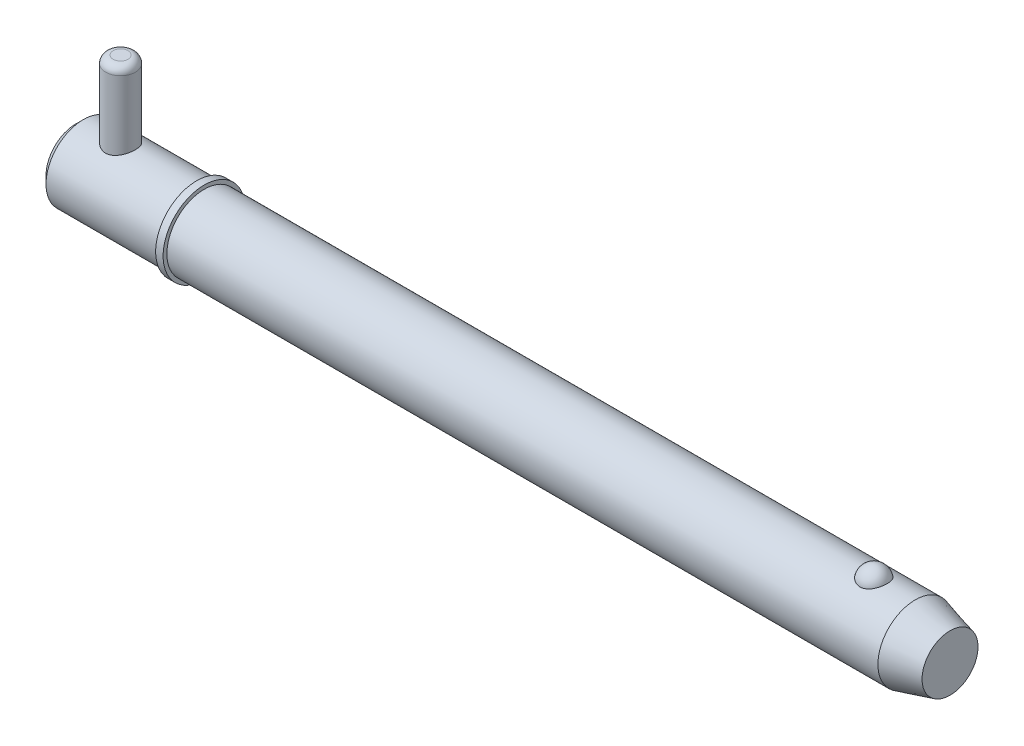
ISO-10303-21;
HEADER;
FILE_DESCRIPTION(('STEP AP214'),'2;1');
FILE_NAME('part.step','',(''),(''),'','','');
FILE_SCHEMA(('AUTOMOTIVE_DESIGN { 1 0 10303 214 1 1 1 1 }'));
ENDSEC;
DATA;
#1=APPLICATION_CONTEXT('core data for automotive mechanical design processes');
#2=APPLICATION_PROTOCOL_DEFINITION('international standard','automotive_design',2000,#1);
#3=PRODUCT_CONTEXT('',#1,'mechanical');
#4=PRODUCT('Part','Part','',(#3));
#5=PRODUCT_RELATED_PRODUCT_CATEGORY('part','',(#4));
#6=PRODUCT_DEFINITION_FORMATION('','',#4);
#7=PRODUCT_DEFINITION_CONTEXT('part definition',#1,'design');
#8=PRODUCT_DEFINITION('design','',#6,#7);
#9=PRODUCT_DEFINITION_SHAPE('','',#8);
#10=(LENGTH_UNIT() NAMED_UNIT(*) SI_UNIT(.MILLI.,.METRE.));
#11=(NAMED_UNIT(*) PLANE_ANGLE_UNIT() SI_UNIT($,.RADIAN.));
#12=(NAMED_UNIT(*) SI_UNIT($,.STERADIAN.) SOLID_ANGLE_UNIT());
#13=UNCERTAINTY_MEASURE_WITH_UNIT(LENGTH_MEASURE(1.E-05),#10,'distance_accuracy_value','');
#14=(GEOMETRIC_REPRESENTATION_CONTEXT(3) GLOBAL_UNCERTAINTY_ASSIGNED_CONTEXT((#13)) GLOBAL_UNIT_ASSIGNED_CONTEXT((#10,
#11,#12)) REPRESENTATION_CONTEXT('',''));
#15=CARTESIAN_POINT('',(0.,0.,0.));
#16=DIRECTION('',(0.,0.,1.));
#17=DIRECTION('',(1.,0.,0.));
#18=AXIS2_PLACEMENT_3D('',#15,#16,#17);
#19=CARTESIAN_POINT('',(9.525,23.81,0.));
#20=DIRECTION('',(0.,-1.,0.));
#21=DIRECTION('',(0.,0.,-1.));
#22=AXIS2_PLACEMENT_3D('',#19,#20,#21);
#23=CYLINDRICAL_SURFACE('',#22,3.175);
#24=CARTESIAN_POINT('',(9.525,-6.3525,0.));
#25=DIRECTION('',(0.,1.,0.));
#26=DIRECTION('',(0.,0.,1.));
#27=AXIS2_PLACEMENT_3D('',#24,#25,#26);
#28=CIRCLE('',#27,3.175);
#29=CARTESIAN_POINT('',(9.525,-6.3525,3.175));
#30=VERTEX_POINT('',#29);
#31=EDGE_CURVE('P0_E25',#30,#30,#28,.T.);
#32=ORIENTED_EDGE('',*,*,#31,.T.);
#33=EDGE_LOOP('',(#32));
#34=FACE_BOUND('',#33,.T.);
#35=CARTESIAN_POINT('',(9.525,22.2225,0.));
#36=DIRECTION('',(0.,1.,0.));
#37=DIRECTION('',(0.,0.,1.));
#38=AXIS2_PLACEMENT_3D('',#35,#36,#37);
#39=CIRCLE('',#38,3.175);
#40=CARTESIAN_POINT('',(9.525,22.2225,3.175));
#41=VERTEX_POINT('',#40);
#42=EDGE_CURVE('P0_E29',#41,#41,#39,.F.);
#43=ORIENTED_EDGE('',*,*,#42,.T.);
#44=EDGE_LOOP('',(#43));
#45=FACE_BOUND('',#44,.T.);
#46=ADVANCED_FACE('P0_F14',(#34,#45),#23,.T.);
#47=CARTESIAN_POINT('',(9.525,23.81,0.));
#48=DIRECTION('',(0.,1.,0.));
#49=DIRECTION('',(0.,0.,1.));
#50=AXIS2_PLACEMENT_3D('',#47,#48,#49);
#51=PLANE('',#50);
#52=CARTESIAN_POINT('',(9.525,23.81,0.));
#53=DIRECTION('',(0.,1.,0.));
#54=DIRECTION('',(0.,0.,1.));
#55=AXIS2_PLACEMENT_3D('',#52,#53,#54);
#56=CIRCLE('',#55,1.5875);
#57=CARTESIAN_POINT('',(9.525,23.81,1.5875));
#58=VERTEX_POINT('',#57);
#59=EDGE_CURVE('P0_E10',#58,#58,#56,.T.);
#60=ORIENTED_EDGE('',*,*,#59,.T.);
#61=EDGE_LOOP('',(#60));
#62=FACE_BOUND('',#61,.T.);
#63=ADVANCED_FACE('P0_F46',(#62),#51,.T.);
#64=CARTESIAN_POINT('',(9.525,-7.94,0.));
#65=DIRECTION('',(0.,1.,0.));
#66=DIRECTION('',(0.,0.,1.));
#67=AXIS2_PLACEMENT_3D('',#64,#65,#66);
#68=PLANE('',#67);
#69=CARTESIAN_POINT('',(9.525,-7.94,0.));
#70=DIRECTION('',(0.,1.,0.));
#71=DIRECTION('',(0.,0.,1.));
#72=AXIS2_PLACEMENT_3D('',#69,#70,#71);
#73=CIRCLE('',#72,1.5875);
#74=CARTESIAN_POINT('',(9.525,-7.94,1.5875));
#75=VERTEX_POINT('',#74);
#76=EDGE_CURVE('P0_E21',#75,#75,#73,.F.);
#77=ORIENTED_EDGE('',*,*,#76,.T.);
#78=EDGE_LOOP('',(#77));
#79=FACE_BOUND('',#78,.T.);
#80=ADVANCED_FACE('P0_F43',(#79),#68,.F.);
#81=CARTESIAN_POINT('',(9.525,-6.3525,0.));
#82=DIRECTION('',(0.,1.,0.));
#83=DIRECTION('',(0.,0.,1.));
#84=AXIS2_PLACEMENT_3D('',#81,#82,#83);
#85=DEGENERATE_TOROIDAL_SURFACE('',#84,1.5875,1.5875,.T.);
#86=ORIENTED_EDGE('',*,*,#76,.F.);
#87=EDGE_LOOP('',(#86));
#88=FACE_BOUND('',#87,.T.);
#89=ORIENTED_EDGE('',*,*,#31,.F.);
#90=EDGE_LOOP('',(#89));
#91=FACE_BOUND('',#90,.T.);
#92=ADVANCED_FACE('P0_F38',(#88,#91),#85,.T.);
#93=CARTESIAN_POINT('',(9.525,22.2225,0.));
#94=DIRECTION('',(0.,1.,0.));
#95=DIRECTION('',(0.,0.,1.));
#96=AXIS2_PLACEMENT_3D('',#93,#94,#95);
#97=DEGENERATE_TOROIDAL_SURFACE('',#96,1.5875,1.5875,.T.);
#98=ORIENTED_EDGE('',*,*,#42,.F.);
#99=EDGE_LOOP('',(#98));
#100=FACE_BOUND('',#99,.T.);
#101=ORIENTED_EDGE('',*,*,#59,.F.);
#102=EDGE_LOOP('',(#101));
#103=FACE_BOUND('',#102,.T.);
#104=ADVANCED_FACE('P0_F16',(#100,#103),#97,.T.);
#105=CLOSED_SHELL('',(#46,#63,#80,#92,#104));
#106=MANIFOLD_SOLID_BREP('P0_B1',#105);
#107=CARTESIAN_POINT('',(0.,0.,0.));
#108=DIRECTION('',(1.,0.,0.));
#109=DIRECTION('',(0.,0.,-1.));
#110=AXIS2_PLACEMENT_3D('',#107,#108,#109);
#111=CYLINDRICAL_SURFACE('',#110,7.94);
#112=CARTESIAN_POINT('',(178.651879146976,0.,0.));
#113=DIRECTION('',(1.,0.,0.));
#114=DIRECTION('',(0.,0.,-1.));
#115=AXIS2_PLACEMENT_3D('',#112,#113,#114);
#116=CIRCLE('',#115,7.94);
#117=CARTESIAN_POINT('',(178.651879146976,0.,-7.94));
#118=VERTEX_POINT('',#117);
#119=EDGE_CURVE('P1_E81',#118,#118,#116,.T.);
#120=ORIENTED_EDGE('',*,*,#119,.F.);
#121=EDGE_LOOP('',(#120));
#122=FACE_BOUND('',#121,.T.);
#123=CARTESIAN_POINT('',(27.31,0.,0.));
#124=DIRECTION('',(1.,0.,0.));
#125=DIRECTION('',(0.,0.,-1.));
#126=AXIS2_PLACEMENT_3D('',#123,#124,#125);
#127=CIRCLE('',#126,7.94);
#128=CARTESIAN_POINT('',(27.31,0.,-7.94));
#129=VERTEX_POINT('',#128);
#130=EDGE_CURVE('P1_E85',#129,#129,#127,.T.);
#131=ORIENTED_EDGE('',*,*,#130,.T.);
#132=EDGE_LOOP('',(#131));
#133=FACE_BOUND('',#132,.T.);
#134=CARTESIAN_POINT('',(169.844907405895,7.37767842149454,2.93486986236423));
#135=CARTESIAN_POINT('',(169.692749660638,7.3776732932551,2.93487505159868));
#136=CARTESIAN_POINT('',(169.540632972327,7.38258419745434,2.92262454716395));
#137=CARTESIAN_POINT('',(169.240928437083,7.40163229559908,2.87404196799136));
#138=CARTESIAN_POINT('',(169.093339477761,7.41576720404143,2.83771585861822));
#139=CARTESIAN_POINT('',(168.807018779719,7.45161576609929,2.74218769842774));
#140=CARTESIAN_POINT('',(168.668274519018,7.47331841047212,2.68301886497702));
#141=CARTESIAN_POINT('',(168.402882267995,7.52194082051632,2.54350967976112));
#142=CARTESIAN_POINT('',(168.276236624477,7.54886159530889,2.46316523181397));
#143=CARTESIAN_POINT('',(168.034534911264,7.60594671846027,2.28090375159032));
#144=CARTESIAN_POINT('',(167.919906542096,7.63618114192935,2.1784421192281));
#145=CARTESIAN_POINT('',(167.708878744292,7.69614046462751,1.95608495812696));
#146=CARTESIAN_POINT('',(167.612482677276,7.72586526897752,1.83618622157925));
#147=CARTESIAN_POINT('',(167.435938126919,7.78314821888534,1.57628086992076));
#148=CARTESIAN_POINT('',(167.356707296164,7.81055035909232,1.43561546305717));
#149=CARTESIAN_POINT('',(167.221797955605,7.85879631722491,1.14236334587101));
#150=CARTESIAN_POINT('',(167.166121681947,7.87963951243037,0.989775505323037));
#151=CARTESIAN_POINT('',(167.07881215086,7.91289645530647,0.674619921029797));
#152=CARTESIAN_POINT('',(167.04753090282,7.92518652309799,0.511941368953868));
#153=CARTESIAN_POINT('',(167.010975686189,7.93958930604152,0.183247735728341));
#154=CARTESIAN_POINT('',(167.005701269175,7.94170219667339,0.0172327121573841));
#155=CARTESIAN_POINT('',(167.021231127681,7.93554931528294,-0.312672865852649));
#156=CARTESIAN_POINT('',(167.041925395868,7.92732732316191,-0.476569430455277));
#157=CARTESIAN_POINT('',(167.10878655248,7.90141534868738,-0.79830524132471));
#158=CARTESIAN_POINT('',(167.154953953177,7.88372517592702,-0.956144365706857));
#159=CARTESIAN_POINT('',(167.271898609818,7.84066230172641,-1.26152073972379));
#160=CARTESIAN_POINT('',(167.342704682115,7.81528060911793,-1.40904568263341));
#161=CARTESIAN_POINT('',(167.507478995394,7.75948672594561,-1.68950598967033));
#162=CARTESIAN_POINT('',(167.601448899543,7.72907417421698,-1.82244030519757));
#163=CARTESIAN_POINT('',(167.810839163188,7.66640424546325,-2.07032792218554));
#164=CARTESIAN_POINT('',(167.926315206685,7.63414223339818,-2.18523308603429));
#165=CARTESIAN_POINT('',(168.1759006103,7.57149681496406,-2.39329737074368));
#166=CARTESIAN_POINT('',(168.310008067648,7.54111321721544,-2.48645870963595));
#167=CARTESIAN_POINT('',(168.590111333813,7.48650742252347,-2.64628132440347));
#168=CARTESIAN_POINT('',(168.735760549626,7.46215900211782,-2.71350554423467));
#169=CARTESIAN_POINT('',(169.037425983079,7.42171253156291,-2.82226614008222));
#170=CARTESIAN_POINT('',(169.193438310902,7.40561140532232,-2.86381209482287));
#171=CARTESIAN_POINT('',(169.502970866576,7.3842679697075,-2.9183907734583));
#172=CARTESIAN_POINT('',(169.656222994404,7.37852109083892,-2.93275024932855));
#173=CARTESIAN_POINT('',(169.963070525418,7.37700973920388,-2.93655208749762));
#174=CARTESIAN_POINT('',(170.116665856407,7.38124333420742,-2.92599927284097));
#175=CARTESIAN_POINT('',(170.414990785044,7.39890635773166,-2.88102897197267));
#176=CARTESIAN_POINT('',(170.559848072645,7.41205491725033,-2.84733999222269));
#177=CARTESIAN_POINT('',(170.84164329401,7.445801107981,-2.75788206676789));
#178=CARTESIAN_POINT('',(170.978580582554,7.46639934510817,-2.70211132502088));
#179=CARTESIAN_POINT('',(171.244061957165,7.51339098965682,-2.56858908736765));
#180=CARTESIAN_POINT('',(171.372354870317,7.53990200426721,-2.4903806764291));
#181=CARTESIAN_POINT('',(171.614244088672,7.59569503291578,-2.31462737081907));
#182=CARTESIAN_POINT('',(171.727837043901,7.6249776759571,-2.21707808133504));
#183=CARTESIAN_POINT('',(171.94322156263,7.68489473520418,-1.99982049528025));
#184=CARTESIAN_POINT('',(172.044148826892,7.71552419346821,-1.87925337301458));
#185=CARTESIAN_POINT('',(172.225186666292,7.77353016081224,-1.6226882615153));
#186=CARTESIAN_POINT('',(172.305293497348,7.80090608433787,-1.48668750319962));
#187=CARTESIAN_POINT('',(172.445361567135,7.85047992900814,-1.1981841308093));
#188=CARTESIAN_POINT('',(172.504587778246,7.87248183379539,-1.04529016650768));
#189=CARTESIAN_POINT('',(172.597982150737,7.90785114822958,-0.731080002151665));
#190=CARTESIAN_POINT('',(172.632149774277,7.92121837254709,-0.569763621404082));
#191=CARTESIAN_POINT('',(172.674795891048,7.93797834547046,-0.242812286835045));
#192=CARTESIAN_POINT('',(172.683204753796,7.94134405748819,-0.0771668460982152));
#193=CARTESIAN_POINT('',(172.673962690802,7.93767937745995,0.253276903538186));
#194=CARTESIAN_POINT('',(172.656312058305,7.93064910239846,0.418075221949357));
#195=CARTESIAN_POINT('',(172.595424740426,7.90695571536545,0.741525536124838));
#196=CARTESIAN_POINT('',(172.552281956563,7.8903279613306,0.900197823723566));
#197=CARTESIAN_POINT('',(172.44135358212,7.84916386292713,1.20759654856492));
#198=CARTESIAN_POINT('',(172.37356656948,7.82462706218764,1.35632241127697));
#199=CARTESIAN_POINT('',(172.214371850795,7.77006699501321,1.64032869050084));
#200=CARTESIAN_POINT('',(172.122861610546,7.74002008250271,1.7755471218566));
#201=CARTESIAN_POINT('',(171.918296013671,7.67774175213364,2.0280064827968));
#202=CARTESIAN_POINT('',(171.805241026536,7.64551037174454,2.14524772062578));
#203=CARTESIAN_POINT('',(171.560831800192,7.58265895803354,2.35778002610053));
#204=CARTESIAN_POINT('',(171.429583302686,7.5520309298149,2.45319004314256));
#205=CARTESIAN_POINT('',(171.151601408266,7.49579792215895,2.61999897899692));
#206=CARTESIAN_POINT('',(171.004867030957,7.4701932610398,2.69139637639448));
#207=CARTESIAN_POINT('',(170.692947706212,7.42622216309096,2.8105324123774));
#208=CARTESIAN_POINT('',(170.527220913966,7.40825002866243,2.85700910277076));
#209=CARTESIAN_POINT('',(170.189279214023,7.38398348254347,2.9191685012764));
#210=CARTESIAN_POINT('',(170.01706702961,7.3776842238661,2.93486399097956));
#211=CARTESIAN_POINT('',(169.844907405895,7.37767842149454,2.93486986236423));
#212=B_SPLINE_CURVE_WITH_KNOTS('',3,(#134,#135,#136,#137,#138,#139,#140,#141,#142,#143,#144,
#145,#146,#147,#148,#149,#150,#151,#152,#153,#154,#155,#156,#157,#158,#159,#160,#161,#162,#163,
#164,#165,#166,#167,#168,#169,#170,#171,#172,#173,#174,#175,#176,#177,#178,#179,#180,#181,#182,
#183,#184,#185,#186,#187,#188,#189,#190,#191,#192,#193,#194,#195,#196,#197,#198,#199,#200,#201,
#202,#203,#204,#205,#206,#207,#208,#209,#210,#211),.UNSPECIFIED.,.T.,.F.,(4,2,2,2,2,2,2,2,2,2,2,
2,2,2,2,2,2,2,2,2,2,2,2,2,2,2,2,2,2,2,2,2,2,2,2,2,2,2,4),(0.,0.455841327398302,
0.911569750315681,1.36663794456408,1.82179423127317,2.2897898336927,2.75787163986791,
3.24685368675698,3.73588214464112,4.23184282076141,4.72779494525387,5.22165321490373,
5.71552141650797,6.2099691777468,6.7044524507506,7.20023431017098,7.69596557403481,
8.18023418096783,8.66432203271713,9.12410697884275,9.58380291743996,10.0296503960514,
10.4755341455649,10.9312349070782,11.3870393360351,11.8654416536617,12.3439299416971,
12.8378875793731,13.3318558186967,13.8271581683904,14.3224549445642,14.8159385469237,
15.3094506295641,15.8051323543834,16.3008055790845,16.7937101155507,17.2866458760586,
17.8026240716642,18.3183879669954),.UNSPECIFIED.);
#213=CARTESIAN_POINT('',(169.844907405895,7.37767842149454,2.93486986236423));
#214=VERTEX_POINT('',#213);
#215=EDGE_CURVE('P1_E35',#214,#214,#212,.T.);
#216=ORIENTED_EDGE('',*,*,#215,.T.);
#217=EDGE_LOOP('',(#216));
#218=FACE_BOUND('',#217,.T.);
#219=ADVANCED_FACE('P1_F13',(#122,#133,#218),#111,.T.);
#220=CARTESIAN_POINT('',(0.,0.,0.));
#221=DIRECTION('',(-1.,0.,0.));
#222=DIRECTION('',(0.,0.,1.));
#223=AXIS2_PLACEMENT_3D('',#220,#221,#222);
#224=PLANE('',#223);
#225=CARTESIAN_POINT('',(0.,0.,0.));
#226=DIRECTION('',(1.,0.,0.));
#227=DIRECTION('',(0.,0.,-1.));
#228=AXIS2_PLACEMENT_3D('',#225,#226,#227);
#229=CIRCLE('',#228,6.352);
#230=CARTESIAN_POINT('',(0.,0.,-6.352));
#231=VERTEX_POINT('',#230);
#232=EDGE_CURVE('P1_E9',#231,#231,#229,.T.);
#233=ORIENTED_EDGE('',*,*,#232,.F.);
#234=EDGE_LOOP('',(#233));
#235=FACE_BOUND('',#234,.T.);
#236=ADVANCED_FACE('P1_F15',(#235),#224,.T.);
#237=CARTESIAN_POINT('',(1.58799999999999,0.,0.));
#238=DIRECTION('',(1.,0.,0.));
#239=DIRECTION('',(0.,0.,-1.));
#240=AXIS2_PLACEMENT_3D('',#237,#238,#239);
#241=CONICAL_SURFACE('',#240,7.94,0.78539816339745);
#242=ORIENTED_EDGE('',*,*,#232,.T.);
#243=EDGE_LOOP('',(#242));
#244=FACE_BOUND('',#243,.T.);
#245=CARTESIAN_POINT('',(1.58799999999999,0.,0.));
#246=DIRECTION('',(1.,0.,0.));
#247=DIRECTION('',(0.,0.,-1.));
#248=AXIS2_PLACEMENT_3D('',#245,#246,#247);
#249=CIRCLE('',#248,7.94);
#250=CARTESIAN_POINT('',(1.58799999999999,0.,-7.94));
#251=VERTEX_POINT('',#250);
#252=EDGE_CURVE('P1_E26',#251,#251,#249,.T.);
#253=ORIENTED_EDGE('',*,*,#252,.F.);
#254=EDGE_LOOP('',(#253));
#255=FACE_BOUND('',#254,.T.);
#256=ADVANCED_FACE('P1_F77',(#244,#255),#241,.T.);
#257=CARTESIAN_POINT('',(0.,0.,0.));
#258=DIRECTION('',(1.,0.,0.));
#259=DIRECTION('',(0.,0.,-1.));
#260=AXIS2_PLACEMENT_3D('',#257,#258,#259);
#261=CYLINDRICAL_SURFACE('',#260,7.94);
#262=CARTESIAN_POINT('',(9.525,-7.27756655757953,3.175));
#263=CARTESIAN_POINT('',(9.43992346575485,-7.27756715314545,3.17499935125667));
#264=CARTESIAN_POINT('',(9.35481882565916,-7.27906496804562,3.1715736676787));
#265=CARTESIAN_POINT('',(9.18524505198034,-7.28499816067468,3.15791803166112));
#266=CARTESIAN_POINT('',(9.100776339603,-7.28943533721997,3.14768391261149));
#267=CARTESIAN_POINT('',(8.84895715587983,-7.30698881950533,3.10684226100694));
#268=CARTESIAN_POINT('',(8.6834173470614,-7.32434654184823,3.06609574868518));
#269=CARTESIAN_POINT('',(8.36278910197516,-7.36806950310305,2.95945910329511));
#270=CARTESIAN_POINT('',(8.20766386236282,-7.39440078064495,2.89366366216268));
#271=CARTESIAN_POINT('',(7.91065319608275,-7.45304562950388,2.73907413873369));
#272=CARTESIAN_POINT('',(7.76876488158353,-7.48535789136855,2.65028508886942));
#273=CARTESIAN_POINT('',(7.49411086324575,-7.55439482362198,2.44679888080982));
#274=CARTESIAN_POINT('',(7.36219910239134,-7.59126138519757,2.33099745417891));
#275=CARTESIAN_POINT('',(7.11904234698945,-7.66408045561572,2.07909838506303));
#276=CARTESIAN_POINT('',(7.00780457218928,-7.70003264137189,1.94299368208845));
#277=CARTESIAN_POINT('',(6.80492173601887,-7.76867514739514,1.64775981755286));
#278=CARTESIAN_POINT('',(6.71422139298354,-7.80118112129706,1.48793473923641));
#279=CARTESIAN_POINT('',(6.56135788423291,-7.85754918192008,1.15376269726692));
#280=CARTESIAN_POINT('',(6.49918311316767,-7.88141478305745,0.979421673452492));
#281=CARTESIAN_POINT('',(6.40818142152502,-7.91680873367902,0.630115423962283));
#282=CARTESIAN_POINT('',(6.3778864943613,-7.9288781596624,0.455588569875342));
#283=CARTESIAN_POINT('',(6.34677743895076,-7.94127547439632,0.103539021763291));
#284=CARTESIAN_POINT('',(6.34595232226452,-7.94160773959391,-0.0739825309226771));
#285=CARTESIAN_POINT('',(6.37300128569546,-7.93082261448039,-0.416371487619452));
#286=CARTESIAN_POINT('',(6.39926693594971,-7.92034690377,-0.581389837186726));
#287=CARTESIAN_POINT('',(6.47701615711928,-7.88998770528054,-0.904449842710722));
#288=CARTESIAN_POINT('',(6.52850157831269,-7.87010352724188,-1.06249098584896));
#289=CARTESIAN_POINT('',(6.65586120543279,-7.82249343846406,-1.36995769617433));
#290=CARTESIAN_POINT('',(6.73209124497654,-7.79465387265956,-1.51921754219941));
#291=CARTESIAN_POINT('',(6.90644286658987,-7.73389606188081,-1.80321183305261));
#292=CARTESIAN_POINT('',(7.00457194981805,-7.70097607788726,-1.93794127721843));
#293=CARTESIAN_POINT('',(7.22744086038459,-7.63084889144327,-2.19843606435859));
#294=CARTESIAN_POINT('',(7.35350432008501,-7.59350211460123,-2.3230330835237));
#295=CARTESIAN_POINT('',(7.62488266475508,-7.52039654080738,-2.54979642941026));
#296=CARTESIAN_POINT('',(7.77020381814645,-7.48463826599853,-2.65195542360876));
#297=CARTESIAN_POINT('',(8.08119298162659,-7.41780943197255,-2.83361305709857));
#298=CARTESIAN_POINT('',(8.24731937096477,-7.38689959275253,-2.91239105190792));
#299=CARTESIAN_POINT('',(8.59204539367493,-7.33515216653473,-3.04038913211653));
#300=CARTESIAN_POINT('',(8.77063684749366,-7.31430804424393,-3.08962840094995));
#301=CARTESIAN_POINT('',(9.12356982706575,-7.28663831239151,-3.15431018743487));
#302=CARTESIAN_POINT('',(9.29750494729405,-7.2790344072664,-3.17163284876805));
#303=CARTESIAN_POINT('',(9.64592502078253,-7.27648884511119,-3.17747282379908));
#304=CARTESIAN_POINT('',(9.82040979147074,-7.28154335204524,-3.16599886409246));
#305=CARTESIAN_POINT('',(10.1545374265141,-7.30294638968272,-3.11628310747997));
#306=CARTESIAN_POINT('',(10.3144598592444,-7.31863587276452,-3.0796016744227));
#307=CARTESIAN_POINT('',(10.625774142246,-7.35872371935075,-2.98253618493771));
#308=CARTESIAN_POINT('',(10.7771640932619,-7.38312401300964,-2.92214687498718));
#309=CARTESIAN_POINT('',(11.0739599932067,-7.4390944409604,-2.77664664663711));
#310=CARTESIAN_POINT('',(11.2188745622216,-7.47091513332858,-2.69063278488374));
#311=CARTESIAN_POINT('',(11.4928722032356,-7.53775867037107,-2.49724834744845));
#312=CARTESIAN_POINT('',(11.6219487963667,-7.57278281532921,-2.38986907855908));
#313=CARTESIAN_POINT('',(11.8705091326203,-7.64520845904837,-2.1474449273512));
#314=CARTESIAN_POINT('',(11.9885816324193,-7.68259462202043,-2.01094304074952));
#315=CARTESIAN_POINT('',(12.2003631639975,-7.75309951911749,-1.71917041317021));
#316=CARTESIAN_POINT('',(12.2940712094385,-7.78621808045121,-1.56389891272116));
#317=CARTESIAN_POINT('',(12.4541161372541,-7.84456050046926,-1.23845027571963));
#318=CARTESIAN_POINT('',(12.5204600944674,-7.86978639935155,-1.06827700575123));
#319=CARTESIAN_POINT('',(12.6231407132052,-7.90943635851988,-0.717928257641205));
#320=CARTESIAN_POINT('',(12.6594936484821,-7.92386627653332,-0.537758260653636));
#321=CARTESIAN_POINT('',(12.6992281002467,-7.93967263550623,-0.185201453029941));
#322=CARTESIAN_POINT('',(12.7046050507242,-7.94183891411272,-0.0130732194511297));
#323=CARTESIAN_POINT('',(12.6875036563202,-7.9350072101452,0.329549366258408));
#324=CARTESIAN_POINT('',(12.6650295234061,-7.92601091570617,0.500043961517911));
#325=CARTESIAN_POINT('',(12.5942896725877,-7.89825976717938,0.829196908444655));
#326=CARTESIAN_POINT('',(12.5468364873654,-7.87981280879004,0.988057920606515));
#327=CARTESIAN_POINT('',(12.4283390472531,-7.83513565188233,1.29553461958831));
#328=CARTESIAN_POINT('',(12.3572904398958,-7.8089040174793,1.44414841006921));
#329=CARTESIAN_POINT('',(12.1900822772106,-7.7497911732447,1.73412879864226));
#330=CARTESIAN_POINT('',(12.0929519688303,-7.71666737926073,1.87488510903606));
#331=CARTESIAN_POINT('',(11.8777894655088,-7.64775894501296,2.13869231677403));
#332=CARTESIAN_POINT('',(11.7597486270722,-7.61197320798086,2.26173585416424));
#333=CARTESIAN_POINT('',(11.4974896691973,-7.53902341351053,2.49449755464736));
#334=CARTESIAN_POINT('',(11.3521039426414,-7.50191102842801,2.60292060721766));
#335=CARTESIAN_POINT('',(11.0440201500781,-7.43289551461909,2.79392602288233));
#336=CARTESIAN_POINT('',(10.8813200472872,-7.40099299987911,2.87650534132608));
#337=CARTESIAN_POINT('',(10.558064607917,-7.3489506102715,3.00682739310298));
#338=CARTESIAN_POINT('',(10.398627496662,-7.32801197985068,3.05703164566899));
#339=CARTESIAN_POINT('',(10.0731242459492,-7.29639491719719,3.13175843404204));
#340=CARTESIAN_POINT('',(9.90707793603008,-7.28568789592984,3.15635254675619));
#341=CARTESIAN_POINT('',(9.70441566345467,-7.27968826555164,3.17013149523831));
#342=CARTESIAN_POINT('',(9.66856669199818,-7.27889378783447,3.17195593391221));
#343=CARTESIAN_POINT('',(9.59681348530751,-7.27783278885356,3.17439036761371));
#344=CARTESIAN_POINT('',(9.56090924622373,-7.27756630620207,3.17500027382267));
#345=CARTESIAN_POINT('',(9.525,-7.27756655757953,3.175));
#346=B_SPLINE_CURVE_WITH_KNOTS('',3,(#262,#263,#264,#265,#266,#267,#268,#269,#270,#271,#272,
#273,#274,#275,#276,#277,#278,#279,#280,#281,#282,#283,#284,#285,#286,#287,#288,#289,#290,#291,
#292,#293,#294,#295,#296,#297,#298,#299,#300,#301,#302,#303,#304,#305,#306,#307,#308,#309,#310,
#311,#312,#313,#314,#315,#316,#317,#318,#319,#320,#321,#322,#323,#324,#325,#326,#327,#328,#329,
#330,#331,#332,#333,#334,#335,#336,#337,#338,#339,#340,#341,#342,#343,#344,#345),.UNSPECIFIED.,
.T.,.F.,(4,2,2,2,2,2,2,2,2,2,2,2,2,2,2,2,2,2,2,2,2,2,2,2,2,2,2,2,2,2,2,2,2,2,2,2,2,2,2,2,2,4),
(0.,0.255187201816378,0.510530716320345,1.0218798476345,1.53131482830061,2.04063840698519,
2.57635929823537,3.11226692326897,3.66929090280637,4.22608806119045,4.75594400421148,
5.28560237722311,5.78552836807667,6.28549104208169,6.79298787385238,7.30065880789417,
7.8416422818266,8.38280228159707,8.93923025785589,9.49529647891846,10.0174074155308,
10.5393601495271,11.0316114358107,11.5239718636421,12.0362920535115,12.5488211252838,
13.0991799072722,13.6495609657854,14.1997996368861,14.7497395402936,15.2638187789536,
15.7778202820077,16.2760504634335,16.7743726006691,17.294711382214,17.8152657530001,
18.3680208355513,18.9208410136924,19.4240423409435,19.9258334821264,20.0335354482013,
20.1412452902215),.UNSPECIFIED.);
#347=CARTESIAN_POINT('',(9.525,-7.27756655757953,3.175));
#348=VERTEX_POINT('',#347);
#349=EDGE_CURVE('P1_E17',#348,#348,#346,.T.);
#350=ORIENTED_EDGE('',*,*,#349,.F.);
#351=EDGE_LOOP('',(#350));
#352=FACE_BOUND('',#351,.T.);
#353=CARTESIAN_POINT('',(9.525,7.27756655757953,3.175));
#354=CARTESIAN_POINT('',(9.61007653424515,7.27756715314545,3.17499935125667));
#355=CARTESIAN_POINT('',(9.69518117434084,7.27906496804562,3.1715736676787));
#356=CARTESIAN_POINT('',(9.86475494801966,7.28499816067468,3.15791803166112));
#357=CARTESIAN_POINT('',(9.949223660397,7.28943533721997,3.14768391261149));
#358=CARTESIAN_POINT('',(10.2010428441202,7.30698881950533,3.10684226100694));
#359=CARTESIAN_POINT('',(10.3665826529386,7.32434654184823,3.06609574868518));
#360=CARTESIAN_POINT('',(10.6872108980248,7.36806950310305,2.95945910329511));
#361=CARTESIAN_POINT('',(10.8423361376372,7.39440078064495,2.89366366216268));
#362=CARTESIAN_POINT('',(11.1393468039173,7.45304562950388,2.73907413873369));
#363=CARTESIAN_POINT('',(11.2812351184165,7.48535789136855,2.65028508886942));
#364=CARTESIAN_POINT('',(11.5558891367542,7.55439482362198,2.44679888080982));
#365=CARTESIAN_POINT('',(11.6878008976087,7.59126138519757,2.33099745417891));
#366=CARTESIAN_POINT('',(11.9309576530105,7.66408045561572,2.07909838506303));
#367=CARTESIAN_POINT('',(12.0421954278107,7.70003264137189,1.94299368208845));
#368=CARTESIAN_POINT('',(12.2450782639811,7.76867514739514,1.64775981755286));
#369=CARTESIAN_POINT('',(12.3357786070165,7.80118112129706,1.48793473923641));
#370=CARTESIAN_POINT('',(12.4886421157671,7.85754918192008,1.15376269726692));
#371=CARTESIAN_POINT('',(12.5508168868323,7.88141478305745,0.979421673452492));
#372=CARTESIAN_POINT('',(12.641818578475,7.91680873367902,0.630115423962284));
#373=CARTESIAN_POINT('',(12.6721135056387,7.9288781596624,0.455588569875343));
#374=CARTESIAN_POINT('',(12.7032225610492,7.94127547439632,0.103539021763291));
#375=CARTESIAN_POINT('',(12.7040476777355,7.94160773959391,-0.0739825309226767));
#376=CARTESIAN_POINT('',(12.6769987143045,7.93082261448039,-0.416371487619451));
#377=CARTESIAN_POINT('',(12.6507330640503,7.92034690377,-0.581389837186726));
#378=CARTESIAN_POINT('',(12.5729838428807,7.88998770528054,-0.904449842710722));
#379=CARTESIAN_POINT('',(12.5214984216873,7.87010352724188,-1.06249098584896));
#380=CARTESIAN_POINT('',(12.3941387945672,7.82249343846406,-1.36995769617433));
#381=CARTESIAN_POINT('',(12.3179087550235,7.79465387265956,-1.51921754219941));
#382=CARTESIAN_POINT('',(12.1435571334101,7.73389606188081,-1.80321183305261));
#383=CARTESIAN_POINT('',(12.0454280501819,7.70097607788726,-1.93794127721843));
#384=CARTESIAN_POINT('',(11.8225591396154,7.63084889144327,-2.19843606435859));
#385=CARTESIAN_POINT('',(11.696495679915,7.59350211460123,-2.3230330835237));
#386=CARTESIAN_POINT('',(11.4251173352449,7.52039654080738,-2.54979642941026));
#387=CARTESIAN_POINT('',(11.2797961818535,7.48463826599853,-2.65195542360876));
#388=CARTESIAN_POINT('',(10.9688070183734,7.41780943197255,-2.83361305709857));
#389=CARTESIAN_POINT('',(10.8026806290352,7.38689959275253,-2.91239105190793));
#390=CARTESIAN_POINT('',(10.4579546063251,7.33515216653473,-3.04038913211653));
#391=CARTESIAN_POINT('',(10.2793631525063,7.31430804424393,-3.08962840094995));
#392=CARTESIAN_POINT('',(9.92643017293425,7.28663831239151,-3.15431018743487));
#393=CARTESIAN_POINT('',(9.75249505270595,7.2790344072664,-3.17163284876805));
#394=CARTESIAN_POINT('',(9.40407497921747,7.2764888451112,-3.17747282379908));
#395=CARTESIAN_POINT('',(9.22959020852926,7.28154335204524,-3.16599886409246));
#396=CARTESIAN_POINT('',(8.89546257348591,7.30294638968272,-3.11628310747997));
#397=CARTESIAN_POINT('',(8.73554014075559,7.31863587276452,-3.0796016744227));
#398=CARTESIAN_POINT('',(8.42422585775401,7.35872371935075,-2.98253618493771));
#399=CARTESIAN_POINT('',(8.27283590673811,7.38312401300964,-2.92214687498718));
#400=CARTESIAN_POINT('',(7.97604000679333,7.4390944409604,-2.77664664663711));
#401=CARTESIAN_POINT('',(7.83112543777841,7.47091513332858,-2.69063278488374));
#402=CARTESIAN_POINT('',(7.55712779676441,7.53775867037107,-2.49724834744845));
#403=CARTESIAN_POINT('',(7.42805120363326,7.57278281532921,-2.38986907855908));
#404=CARTESIAN_POINT('',(7.17949086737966,7.64520845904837,-2.1474449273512));
#405=CARTESIAN_POINT('',(7.06141836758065,7.68259462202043,-2.01094304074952));
#406=CARTESIAN_POINT('',(6.8496368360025,7.75309951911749,-1.71917041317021));
#407=CARTESIAN_POINT('',(6.75592879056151,7.78621808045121,-1.56389891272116));
#408=CARTESIAN_POINT('',(6.59588386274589,7.84456050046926,-1.23845027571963));
#409=CARTESIAN_POINT('',(6.52953990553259,7.86978639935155,-1.06827700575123));
#410=CARTESIAN_POINT('',(6.42685928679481,7.90943635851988,-0.717928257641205));
#411=CARTESIAN_POINT('',(6.39050635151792,7.92386627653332,-0.537758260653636));
#412=CARTESIAN_POINT('',(6.35077189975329,7.93967263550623,-0.18520145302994));
#413=CARTESIAN_POINT('',(6.34539494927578,7.94183891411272,-0.0130732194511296));
#414=CARTESIAN_POINT('',(6.36249634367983,7.9350072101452,0.329549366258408));
#415=CARTESIAN_POINT('',(6.38497047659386,7.92601091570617,0.500043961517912));
#416=CARTESIAN_POINT('',(6.45571032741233,7.89825976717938,0.829196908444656));
#417=CARTESIAN_POINT('',(6.50316351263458,7.87981280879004,0.988057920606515));
#418=CARTESIAN_POINT('',(6.62166095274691,7.83513565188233,1.29553461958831));
#419=CARTESIAN_POINT('',(6.69270956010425,7.8089040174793,1.44414841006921));
#420=CARTESIAN_POINT('',(6.85991772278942,7.7497911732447,1.73412879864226));
#421=CARTESIAN_POINT('',(6.95704803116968,7.71666737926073,1.87488510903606));
#422=CARTESIAN_POINT('',(7.17221053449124,7.64775894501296,2.13869231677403));
#423=CARTESIAN_POINT('',(7.29025137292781,7.61197320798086,2.26173585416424));
#424=CARTESIAN_POINT('',(7.55251033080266,7.53902341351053,2.49449755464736));
#425=CARTESIAN_POINT('',(7.69789605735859,7.50191102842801,2.60292060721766));
#426=CARTESIAN_POINT('',(8.00597984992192,7.43289551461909,2.79392602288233));
#427=CARTESIAN_POINT('',(8.16867995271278,7.40099299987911,2.87650534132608));
#428=CARTESIAN_POINT('',(8.49193539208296,7.3489506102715,3.00682739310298));
#429=CARTESIAN_POINT('',(8.65137250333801,7.32801197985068,3.05703164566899));
#430=CARTESIAN_POINT('',(8.97687575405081,7.29639491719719,3.13175843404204));
#431=CARTESIAN_POINT('',(9.14292206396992,7.28568789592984,3.15635254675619));
#432=CARTESIAN_POINT('',(9.34558433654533,7.27968826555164,3.17013149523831));
#433=CARTESIAN_POINT('',(9.38143330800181,7.27889378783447,3.17195593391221));
#434=CARTESIAN_POINT('',(9.45318651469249,7.27783278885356,3.17439036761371));
#435=CARTESIAN_POINT('',(9.48909075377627,7.27756630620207,3.17500027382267));
#436=CARTESIAN_POINT('',(9.525,7.27756655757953,3.175));
#437=B_SPLINE_CURVE_WITH_KNOTS('',3,(#353,#354,#355,#356,#357,#358,#359,#360,#361,#362,#363,
#364,#365,#366,#367,#368,#369,#370,#371,#372,#373,#374,#375,#376,#377,#378,#379,#380,#381,#382,
#383,#384,#385,#386,#387,#388,#389,#390,#391,#392,#393,#394,#395,#396,#397,#398,#399,#400,#401,
#402,#403,#404,#405,#406,#407,#408,#409,#410,#411,#412,#413,#414,#415,#416,#417,#418,#419,#420,
#421,#422,#423,#424,#425,#426,#427,#428,#429,#430,#431,#432,#433,#434,#435,#436),.UNSPECIFIED.,
.T.,.F.,(4,2,2,2,2,2,2,2,2,2,2,2,2,2,2,2,2,2,2,2,2,2,2,2,2,2,2,2,2,2,2,2,2,2,2,2,2,2,2,2,2,4),
(0.,0.255187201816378,0.510530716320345,1.0218798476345,1.53131482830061,2.04063840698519,
2.57635929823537,3.11226692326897,3.66929090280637,4.22608806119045,4.75594400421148,
5.2856023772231,5.78552836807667,6.28549104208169,6.79298787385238,7.30065880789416,
7.8416422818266,8.38280228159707,8.9392302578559,9.49529647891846,10.0174074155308,
10.5393601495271,11.0316114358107,11.5239718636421,12.0362920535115,12.5488211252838,
13.0991799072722,13.6495609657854,14.1997996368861,14.7497395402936,15.2638187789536,
15.7778202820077,16.2760504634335,16.7743726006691,17.294711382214,17.8152657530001,
18.3680208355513,18.9208410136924,19.4240423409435,19.9258334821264,20.0335354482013,
20.1412452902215),.UNSPECIFIED.);
#438=CARTESIAN_POINT('',(9.525,7.27756655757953,3.175));
#439=VERTEX_POINT('',#438);
#440=EDGE_CURVE('P1_E43',#439,#439,#437,.T.);
#441=ORIENTED_EDGE('',*,*,#440,.F.);
#442=EDGE_LOOP('',(#441));
#443=FACE_BOUND('',#442,.T.);
#444=ORIENTED_EDGE('',*,*,#252,.T.);
#445=EDGE_LOOP('',(#444));
#446=FACE_BOUND('',#445,.T.);
#447=CARTESIAN_POINT('',(25.722,0.,0.));
#448=DIRECTION('',(1.,0.,0.));
#449=DIRECTION('',(0.,0.,-1.));
#450=AXIS2_PLACEMENT_3D('',#447,#448,#449);
#451=CIRCLE('',#450,7.94);
#452=CARTESIAN_POINT('',(25.722,0.,-7.94));
#453=VERTEX_POINT('',#452);
#454=EDGE_CURVE('P1_E31',#453,#453,#451,.T.);
#455=ORIENTED_EDGE('',*,*,#454,.F.);
#456=EDGE_LOOP('',(#455));
#457=FACE_BOUND('',#456,.T.);
#458=ADVANCED_FACE('P1_F103',(#352,#443,#446,#457),#261,.T.);
#459=CARTESIAN_POINT('',(25.722,7.94,0.));
#460=DIRECTION('',(-1.,0.,0.));
#461=DIRECTION('',(0.,0.,1.));
#462=AXIS2_PLACEMENT_3D('',#459,#460,#461);
#463=PLANE('',#462);
#464=ORIENTED_EDGE('',*,*,#454,.T.);
#465=EDGE_LOOP('',(#464));
#466=FACE_BOUND('',#465,.T.);
#467=CARTESIAN_POINT('',(25.722,0.,0.));
#468=DIRECTION('',(1.,0.,0.));
#469=DIRECTION('',(0.,0.,-1.));
#470=AXIS2_PLACEMENT_3D('',#467,#468,#469);
#471=CIRCLE('',#470,8.734);
#472=CARTESIAN_POINT('',(25.722,0.,-8.734));
#473=VERTEX_POINT('',#472);
#474=EDGE_CURVE('P1_E91',#473,#473,#471,.T.);
#475=ORIENTED_EDGE('',*,*,#474,.F.);
#476=EDGE_LOOP('',(#475));
#477=FACE_BOUND('',#476,.T.);
#478=ADVANCED_FACE('P1_F100',(#466,#477),#463,.T.);
#479=CARTESIAN_POINT('',(0.,0.,0.));
#480=DIRECTION('',(1.,0.,0.));
#481=DIRECTION('',(0.,0.,-1.));
#482=AXIS2_PLACEMENT_3D('',#479,#480,#481);
#483=CYLINDRICAL_SURFACE('',#482,8.734);
#484=ORIENTED_EDGE('',*,*,#474,.T.);
#485=EDGE_LOOP('',(#484));
#486=FACE_BOUND('',#485,.T.);
#487=CARTESIAN_POINT('',(27.31,0.,0.));
#488=DIRECTION('',(1.,0.,0.));
#489=DIRECTION('',(0.,0.,-1.));
#490=AXIS2_PLACEMENT_3D('',#487,#488,#489);
#491=CIRCLE('',#490,8.734);
#492=CARTESIAN_POINT('',(27.31,0.,-8.734));
#493=VERTEX_POINT('',#492);
#494=EDGE_CURVE('P1_E88',#493,#493,#491,.T.);
#495=ORIENTED_EDGE('',*,*,#494,.F.);
#496=EDGE_LOOP('',(#495));
#497=FACE_BOUND('',#496,.T.);
#498=ADVANCED_FACE('P1_F68',(#486,#497),#483,.T.);
#499=CARTESIAN_POINT('',(27.31,8.734,0.));
#500=DIRECTION('',(1.,0.,0.));
#501=DIRECTION('',(0.,0.,-1.));
#502=AXIS2_PLACEMENT_3D('',#499,#500,#501);
#503=PLANE('',#502);
#504=ORIENTED_EDGE('',*,*,#494,.T.);
#505=EDGE_LOOP('',(#504));
#506=FACE_BOUND('',#505,.T.);
#507=ORIENTED_EDGE('',*,*,#130,.F.);
#508=EDGE_LOOP('',(#507));
#509=FACE_BOUND('',#508,.T.);
#510=ADVANCED_FACE('P1_F62',(#506,#509),#503,.T.);
#511=CARTESIAN_POINT('',(186.06,0.,0.));
#512=DIRECTION('',(-1.,0.,0.));
#513=DIRECTION('',(0.,0.,1.));
#514=AXIS2_PLACEMENT_3D('',#511,#512,#513);
#515=CONICAL_SURFACE('',#514,5.95500000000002,0.26179938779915);
#516=ORIENTED_EDGE('',*,*,#119,.T.);
#517=EDGE_LOOP('',(#516));
#518=FACE_BOUND('',#517,.T.);
#519=CARTESIAN_POINT('',(186.06,0.,0.));
#520=DIRECTION('',(1.,0.,0.));
#521=DIRECTION('',(0.,0.,-1.));
#522=AXIS2_PLACEMENT_3D('',#519,#520,#521);
#523=CIRCLE('',#522,5.95500000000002);
#524=CARTESIAN_POINT('',(186.06,0.,-5.95500000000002));
#525=VERTEX_POINT('',#524);
#526=EDGE_CURVE('P1_E42',#525,#525,#523,.T.);
#527=ORIENTED_EDGE('',*,*,#526,.F.);
#528=EDGE_LOOP('',(#527));
#529=FACE_BOUND('',#528,.T.);
#530=ADVANCED_FACE('P1_F59',(#518,#529),#515,.T.);
#531=CARTESIAN_POINT('',(186.06,5.95500000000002,0.));
#532=DIRECTION('',(1.,0.,0.));
#533=DIRECTION('',(0.,0.,-1.));
#534=AXIS2_PLACEMENT_3D('',#531,#532,#533);
#535=PLANE('',#534);
#536=ORIENTED_EDGE('',*,*,#526,.T.);
#537=EDGE_LOOP('',(#536));
#538=FACE_BOUND('',#537,.T.);
#539=ADVANCED_FACE('P1_F55',(#538),#535,.T.);
#540=CARTESIAN_POINT('',(169.844907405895,7.146,0.));
#541=DIRECTION('',(-1.,0.,0.));
#542=DIRECTION('',(0.,1.,0.));
#543=AXIS2_PLACEMENT_3D('',#540,#541,#542);
#544=SPHERICAL_SURFACE('',#543,2.944);
#545=ORIENTED_EDGE('',*,*,#215,.F.);
#546=EDGE_LOOP('',(#545));
#547=FACE_BOUND('',#546,.T.);
#548=ADVANCED_FACE('P1_F50',(#547),#544,.T.);
#549=CARTESIAN_POINT('',(9.525,-8.734,0.));
#550=DIRECTION('',(0.,1.,0.));
#551=DIRECTION('',(0.,0.,1.));
#552=AXIS2_PLACEMENT_3D('',#549,#550,#551);
#553=CYLINDRICAL_SURFACE('',#552,3.175);
#554=ORIENTED_EDGE('',*,*,#349,.T.);
#555=EDGE_LOOP('',(#554));
#556=FACE_BOUND('',#555,.T.);
#557=ORIENTED_EDGE('',*,*,#440,.T.);
#558=EDGE_LOOP('',(#557));
#559=FACE_BOUND('',#558,.T.);
#560=ADVANCED_FACE('P1_F54',(#556,#559),#553,.F.);
#561=CLOSED_SHELL('',(#219,#236,#256,#458,#478,#498,#510,#530,#539,#548,#560));
#562=MANIFOLD_SOLID_BREP('P1_B1',#561);
#563=ADVANCED_BREP_SHAPE_REPRESENTATION('',(#18,#106,#562),#14);
#564=SHAPE_DEFINITION_REPRESENTATION(#9,#563);
ENDSEC;
END-ISO-10303-21;
